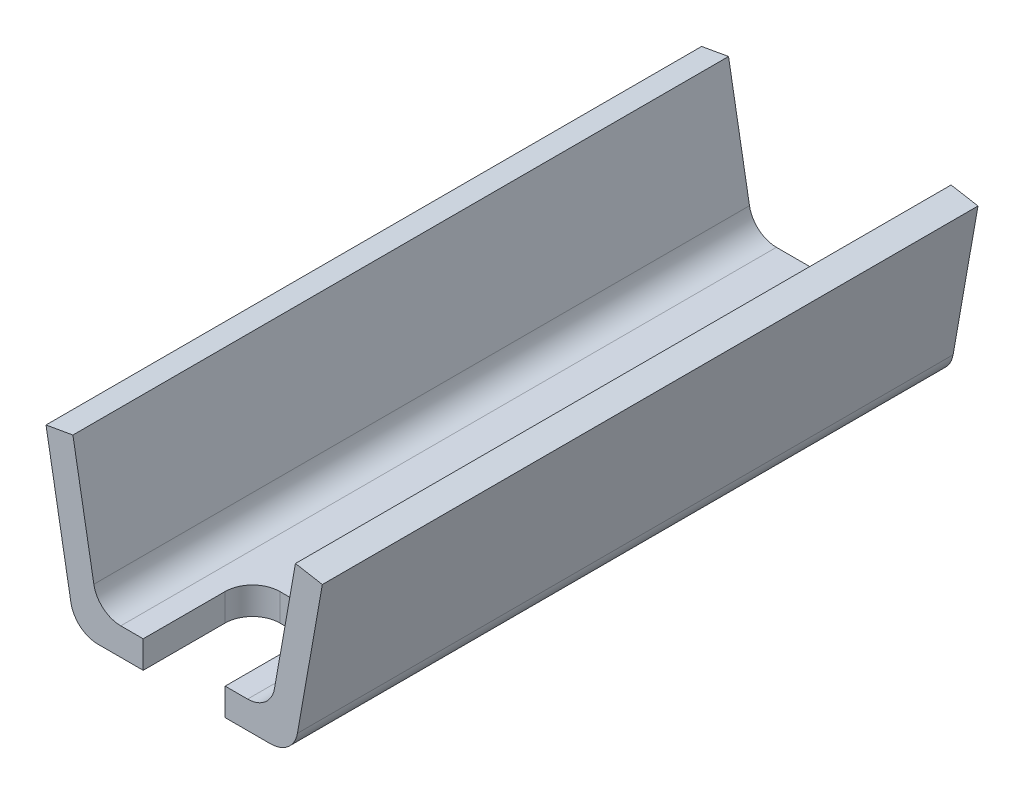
from build123d import *

# Parameters (mm, degrees)
EXTRUDE_1_DEPTH     = 120
CUT_EXTRUDE_1_DEPTH = 127.461151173


with BuildPart() as part:
    # Sketch 1 → Extrude 1 (new body)
    with BuildSketch(Plane.XY):
        with BuildLine():
            Line((-15.804501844, 0), (15.804501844, 0))
            ThreePointArc((15.804501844, 0), (19.018439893, 1.169777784), (20.728540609, 4.131759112))
            Line((20.728540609, 4.131759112), (25.289809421, 30))
            Line((25.289809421, 30), (20.365770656, 30.868240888))
            Line((20.365770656, 30.868240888), (16.533042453, 9.131759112))
            ThreePointArc((16.533042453, 9.131759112), (14.822941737, 6.169777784), (11.609003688, 5))
            Line((11.609003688, 5), (-11.609003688, 5))
            ThreePointArc((-11.609003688, 5), (-14.822941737, 6.169777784), (-16.533042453, 9.131759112))
            Line((-16.533042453, 9.131759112), (-20.365770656, 30.868240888))
            Line((-20.365770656, 30.868240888), (-25.289809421, 30))
            Line((-25.289809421, 30), (-20.728540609, 4.131759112))
            ThreePointArc((-20.728540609, 4.131759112), (-19.018439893, 1.169777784), (-15.804501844, 0))
        make_face()
    extrude(amount=EXTRUDE_1_DEPTH)

    # Sketch 2 → Cut-Extrude 1 (cut, through all)
    with BuildSketch(Plane.XZ):
        with BuildLine():
            Line((-7.5, 120), (7.5, 120))
            Line((7.5, 120), (7.5, 105))
            ThreePointArc((7.5, 105), (6.035533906, 101.464466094), (2.5, 100))
            Line((2.5, 100), (-2.5, 100))
            ThreePointArc((-2.5, 100), (-6.035533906, 101.464466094), (-7.5, 105))
            Line((-7.5, 105), (-7.5, 120))
        make_face()
    extrude(amount=-CUT_EXTRUDE_1_DEPTH, mode=Mode.SUBTRACT)


solid = part.part
